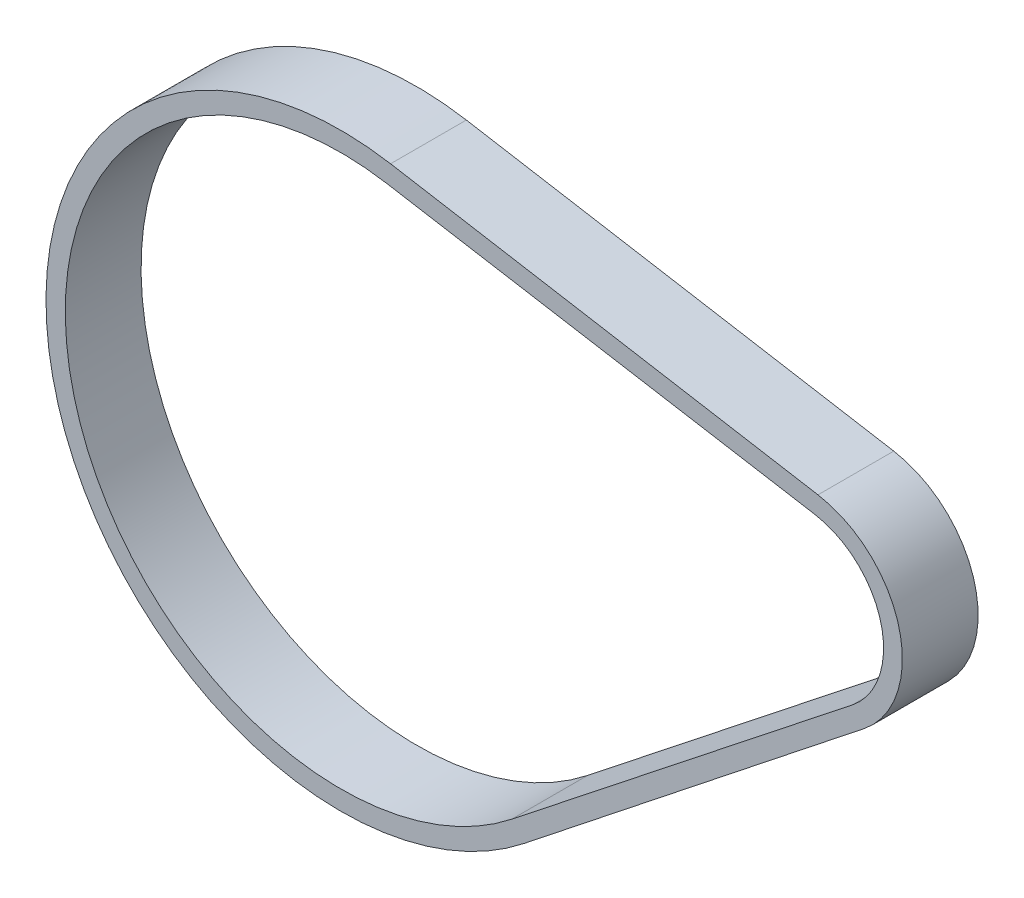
from build123d import *

# Parameters (mm, degrees)
BASE_EXTRUSION_DEPTH = 28


with BuildPart() as part:
    # Esquisse1 → Base-Extrusion (new body)
    with BuildSketch(Plane.XY):
        with BuildLine():
            Line((18.351063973, 107.444117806), (176.31343944, 80.464719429))
            ThreePointArc((176.31343944, 80.464719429), (206.32950471, 52.796079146), (193.292224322, 14.110847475))
            Line((193.292224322, 14.110847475), (67.702732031, -85.424470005))
            ThreePointArc((67.702732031, -85.424470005), (-105.597760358, -27.020603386), (18.351063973, 107.444117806))
        make_face()
        with BuildLine():
            Line((17.023694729, 100.427353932), (175.107442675, 73.63017805))
            ThreePointArc((175.107442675, 73.63017805), (199.606124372, 51.075684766), (188.951712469, 19.526135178))
            Line((188.951712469, 19.526135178), (63.168240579, -79.907652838))
            ThreePointArc((63.168240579, -79.907652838), (-98.680622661, -25.250629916), (17.023694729, 100.427353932))
        make_face(mode=Mode.SUBTRACT)
    extrude(amount=BASE_EXTRUSION_DEPTH)


solid = part.part
